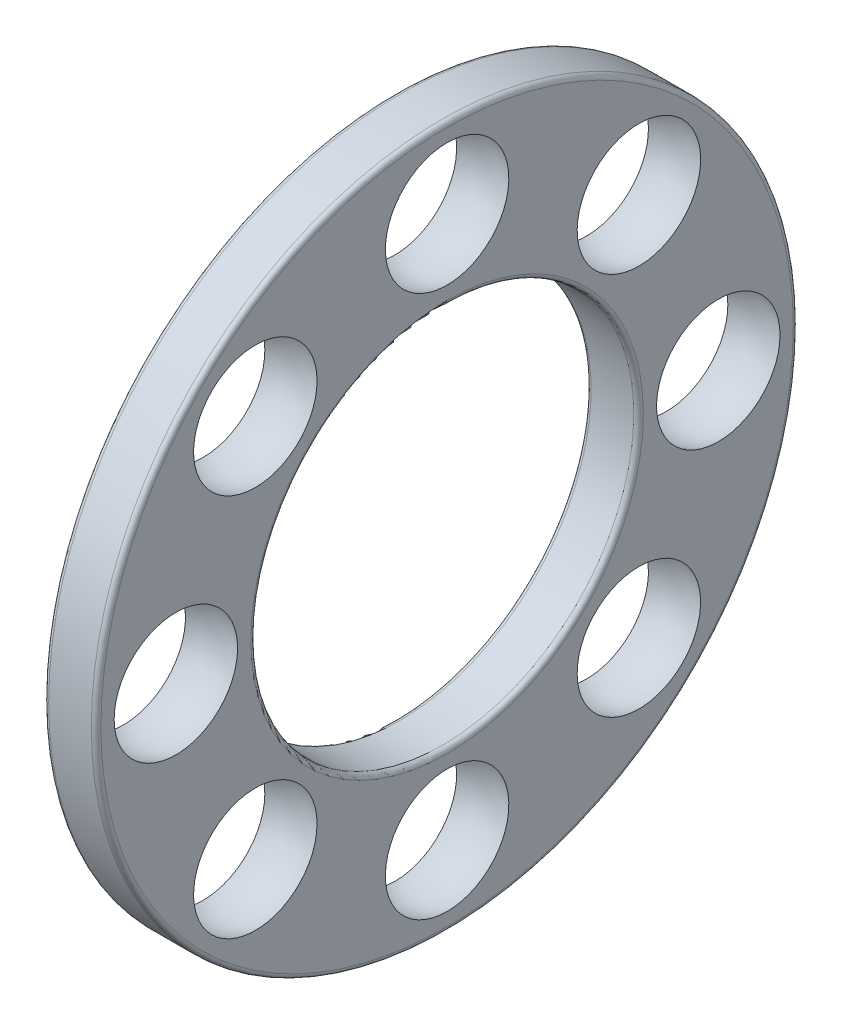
ISO-10303-21;
HEADER;
FILE_DESCRIPTION(('STEP AP214'),'2;1');
FILE_NAME('part.step','',(''),(''),'','','');
FILE_SCHEMA(('AUTOMOTIVE_DESIGN { 1 0 10303 214 1 1 1 1 }'));
ENDSEC;
DATA;
#1=APPLICATION_CONTEXT('core data for automotive mechanical design processes');
#2=APPLICATION_PROTOCOL_DEFINITION('international standard','automotive_design',2000,#1);
#3=PRODUCT_CONTEXT('',#1,'mechanical');
#4=PRODUCT('Part','Part','',(#3));
#5=PRODUCT_RELATED_PRODUCT_CATEGORY('part','',(#4));
#6=PRODUCT_DEFINITION_FORMATION('','',#4);
#7=PRODUCT_DEFINITION_CONTEXT('part definition',#1,'design');
#8=PRODUCT_DEFINITION('design','',#6,#7);
#9=PRODUCT_DEFINITION_SHAPE('','',#8);
#10=(LENGTH_UNIT() NAMED_UNIT(*) SI_UNIT(.MILLI.,.METRE.));
#11=(NAMED_UNIT(*) PLANE_ANGLE_UNIT() SI_UNIT($,.RADIAN.));
#12=(NAMED_UNIT(*) SI_UNIT($,.STERADIAN.) SOLID_ANGLE_UNIT());
#13=UNCERTAINTY_MEASURE_WITH_UNIT(LENGTH_MEASURE(1.E-05),#10,'distance_accuracy_value','');
#14=(GEOMETRIC_REPRESENTATION_CONTEXT(3) GLOBAL_UNCERTAINTY_ASSIGNED_CONTEXT((#13)) GLOBAL_UNIT_ASSIGNED_CONTEXT((#10,
#11,#12)) REPRESENTATION_CONTEXT('',''));
#15=CARTESIAN_POINT('',(0.,0.,0.));
#16=DIRECTION('',(0.,0.,1.));
#17=DIRECTION('',(1.,0.,0.));
#18=AXIS2_PLACEMENT_3D('',#15,#16,#17);
#19=CARTESIAN_POINT('',(-0.667981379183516,3.88578058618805E-13,0.));
#20=DIRECTION('',(-1.00000000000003,0.,0.));
#21=DIRECTION('',(0.,0.,1.00000000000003));
#22=AXIS2_PLACEMENT_3D('',#19,#20,#21);
#23=TOROIDAL_SURFACE('',#22,10.85,0.15);
#24=CARTESIAN_POINT('',(-0.817981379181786,2.83106871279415E-12,0.));
#25=DIRECTION('',(-1.00000000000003,0.,0.));
#26=DIRECTION('',(0.,0.,1.00000000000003));
#27=AXIS2_PLACEMENT_3D('',#24,#25,#26);
#28=CIRCLE('',#27,10.85);
#29=CARTESIAN_POINT('',(-0.817981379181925,2.89659663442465E-12,10.8500000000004));
#30=VERTEX_POINT('',#29);
#31=EDGE_CURVE('E10',#30,#30,#28,.T.);
#32=ORIENTED_EDGE('',*,*,#31,.F.);
#33=EDGE_LOOP('',(#32));
#34=FACE_BOUND('',#33,.T.);
#35=CARTESIAN_POINT('',(-0.667981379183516,3.88578058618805E-13,0.));
#36=DIRECTION('',(-1.00000000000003,0.,0.));
#37=DIRECTION('',(0.,0.,1.00000000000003));
#38=AXIS2_PLACEMENT_3D('',#35,#36,#37);
#39=CIRCLE('',#38,11.);
#40=CARTESIAN_POINT('',(-0.667981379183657,4.55011896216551E-13,11.0000000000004));
#41=VERTEX_POINT('',#40);
#42=EDGE_CURVE('E89',#41,#41,#39,.T.);
#43=ORIENTED_EDGE('',*,*,#42,.T.);
#44=EDGE_LOOP('',(#43));
#45=FACE_BOUND('',#44,.T.);
#46=ADVANCED_FACE('F24',(#34,#45),#23,.T.);
#47=CARTESIAN_POINT('',(-0.817981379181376,6.15000000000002,0.));
#48=DIRECTION('',(1.00000000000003,0.,0.));
#49=DIRECTION('',(0.,0.,-1.00000000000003));
#50=AXIS2_PLACEMENT_3D('',#47,#48,#49);
#51=PLANE('',#50);
#52=CARTESIAN_POINT('',(-0.817981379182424,6.01040764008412,6.01040764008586));
#53=DIRECTION('',(1.00000000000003,0.,0.));
#54=DIRECTION('',(0.,0.,-1.00000000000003));
#55=AXIS2_PLACEMENT_3D('',#52,#53,#54);
#56=CIRCLE('',#55,1.93414230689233);
#57=CARTESIAN_POINT('',(-0.817981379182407,7.37805278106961,7.37805278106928));
#58=VERTEX_POINT('',#57);
#59=EDGE_CURVE('E66',#58,#58,#56,.T.);
#60=ORIENTED_EDGE('',*,*,#59,.T.);
#61=EDGE_LOOP('',(#60));
#62=FACE_BOUND('',#61,.T.);
#63=CARTESIAN_POINT('',(-0.817981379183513,1.13797860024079E-12,8.50000000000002));
#64=DIRECTION('',(1.00000000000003,0.,0.));
#65=DIRECTION('',(0.,0.,-1.00000000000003));
#66=AXIS2_PLACEMENT_3D('',#63,#64,#65);
#67=CIRCLE('',#66,1.93414230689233);
#68=CARTESIAN_POINT('',(-0.817981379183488,2.25201707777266E-12,10.4341423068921));
#69=VERTEX_POINT('',#68);
#70=EDGE_CURVE('E63',#69,#69,#67,.T.);
#71=ORIENTED_EDGE('',*,*,#70,.T.);
#72=EDGE_LOOP('',(#71));
#73=FACE_BOUND('',#72,.T.);
#74=CARTESIAN_POINT('',(-0.817981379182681,-6.01040764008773,6.01040764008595));
#75=DIRECTION('',(1.00000000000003,0.,0.));
#76=DIRECTION('',(0.,0.,-1.00000000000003));
#77=AXIS2_PLACEMENT_3D('',#74,#75,#76);
#78=CIRCLE('',#77,1.93414230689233);
#79=CARTESIAN_POINT('',(-0.817981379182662,-7.37805278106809,7.37805278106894));
#80=VERTEX_POINT('',#79);
#81=EDGE_CURVE('E60',#80,#80,#78,.T.);
#82=ORIENTED_EDGE('',*,*,#81,.T.);
#83=EDGE_LOOP('',(#82));
#84=FACE_BOUND('',#83,.T.);
#85=CARTESIAN_POINT('',(-0.817981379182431,-8.49999999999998,0.));
#86=DIRECTION('',(1.00000000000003,0.,0.));
#87=DIRECTION('',(0.,0.,-1.00000000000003));
#88=AXIS2_PLACEMENT_3D('',#85,#86,#87);
#89=CIRCLE('',#88,1.93414230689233);
#90=CARTESIAN_POINT('',(-0.81798137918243,-10.4341423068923,0.));
#91=VERTEX_POINT('',#90);
#92=EDGE_CURVE('E56',#91,#91,#89,.T.);
#93=ORIENTED_EDGE('',*,*,#92,.T.);
#94=EDGE_LOOP('',(#93));
#95=FACE_BOUND('',#94,.T.);
#96=CARTESIAN_POINT('',(-0.817981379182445,-6.01040764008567,-6.01040764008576));
#97=DIRECTION('',(1.00000000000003,0.,0.));
#98=DIRECTION('',(0.,0.,-1.00000000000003));
#99=AXIS2_PLACEMENT_3D('',#96,#97,#98);
#100=CIRCLE('',#99,1.93414230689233);
#101=CARTESIAN_POINT('',(-0.817981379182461,-7.37805278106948,-7.37805278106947));
#102=VERTEX_POINT('',#101);
#103=EDGE_CURVE('E52',#102,#102,#100,.T.);
#104=ORIENTED_EDGE('',*,*,#103,.T.);
#105=EDGE_LOOP('',(#104));
#106=FACE_BOUND('',#105,.T.);
#107=CARTESIAN_POINT('',(-0.817981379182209,2.1094237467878E-12,-8.50000000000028));
#108=DIRECTION('',(1.00000000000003,0.,0.));
#109=DIRECTION('',(0.,0.,-1.00000000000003));
#110=AXIS2_PLACEMENT_3D('',#107,#108,#109);
#111=CIRCLE('',#110,1.93414230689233);
#112=CARTESIAN_POINT('',(-0.817981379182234,2.09050737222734E-12,-10.4341423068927));
#113=VERTEX_POINT('',#112);
#114=EDGE_CURVE('E48',#113,#113,#111,.T.);
#115=ORIENTED_EDGE('',*,*,#114,.T.);
#116=EDGE_LOOP('',(#115));
#117=FACE_BOUND('',#116,.T.);
#118=CARTESIAN_POINT('',(-0.817981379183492,6.01040764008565,-6.01040764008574));
#119=DIRECTION('',(1.00000000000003,0.,0.));
#120=DIRECTION('',(0.,0.,-1.00000000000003));
#121=AXIS2_PLACEMENT_3D('',#118,#119,#120);
#122=CIRCLE('',#121,1.93414230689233);
#123=CARTESIAN_POINT('',(-0.817981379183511,7.37805278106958,-7.37805278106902));
#124=VERTEX_POINT('',#123);
#125=EDGE_CURVE('E44',#124,#124,#122,.T.);
#126=ORIENTED_EDGE('',*,*,#125,.T.);
#127=EDGE_LOOP('',(#126));
#128=FACE_BOUND('',#127,.T.);
#129=CARTESIAN_POINT('',(-0.817981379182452,8.49999999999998,0.));
#130=DIRECTION('',(1.00000000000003,0.,0.));
#131=DIRECTION('',(0.,0.,-1.00000000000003));
#132=AXIS2_PLACEMENT_3D('',#129,#130,#131);
#133=CIRCLE('',#132,1.93414230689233);
#134=CARTESIAN_POINT('',(-0.817981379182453,10.4341423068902,0.));
#135=VERTEX_POINT('',#134);
#136=EDGE_CURVE('E43',#135,#135,#133,.T.);
#137=ORIENTED_EDGE('',*,*,#136,.T.);
#138=EDGE_LOOP('',(#137));
#139=FACE_BOUND('',#138,.T.);
#140=CARTESIAN_POINT('',(-0.817981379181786,2.83106871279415E-12,0.));
#141=DIRECTION('',(-1.00000000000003,0.,0.));
#142=DIRECTION('',(0.,0.,1.00000000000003));
#143=AXIS2_PLACEMENT_3D('',#140,#141,#142);
#144=CIRCLE('',#143,6.15);
#145=CARTESIAN_POINT('',(-0.817981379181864,2.86821126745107E-12,6.15000000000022));
#146=VERTEX_POINT('',#145);
#147=EDGE_CURVE('E31',#146,#146,#144,.T.);
#148=ORIENTED_EDGE('',*,*,#147,.F.);
#149=EDGE_LOOP('',(#148));
#150=FACE_BOUND('',#149,.T.);
#151=ORIENTED_EDGE('',*,*,#31,.T.);
#152=EDGE_LOOP('',(#151));
#153=FACE_BOUND('',#152,.T.);
#154=ADVANCED_FACE('F111',(#62,#73,#84,#95,#106,#117,#128,#139,#150,#153),#51,.F.);
#155=CARTESIAN_POINT('',(-0.667981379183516,3.88578058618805E-13,0.));
#156=DIRECTION('',(-1.00000000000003,0.,0.));
#157=DIRECTION('',(0.,0.,1.00000000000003));
#158=AXIS2_PLACEMENT_3D('',#155,#156,#157);
#159=TOROIDAL_SURFACE('',#158,6.15,0.15);
#160=CARTESIAN_POINT('',(-0.667981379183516,3.88578058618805E-13,0.));
#161=DIRECTION('',(-1.00000000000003,0.,0.));
#162=DIRECTION('',(0.,0.,1.00000000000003));
#163=AXIS2_PLACEMENT_3D('',#160,#161,#162);
#164=CIRCLE('',#163,6.);
#165=CARTESIAN_POINT('',(-0.667981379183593,4.24814697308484E-13,6.00000000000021));
#166=VERTEX_POINT('',#165);
#167=EDGE_CURVE('E36',#166,#166,#164,.T.);
#168=ORIENTED_EDGE('',*,*,#167,.F.);
#169=EDGE_LOOP('',(#168));
#170=FACE_BOUND('',#169,.T.);
#171=ORIENTED_EDGE('',*,*,#147,.T.);
#172=EDGE_LOOP('',(#171));
#173=FACE_BOUND('',#172,.T.);
#174=ADVANCED_FACE('F108',(#170,#173),#159,.T.);
#175=CARTESIAN_POINT('',(-6.56248115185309,1.36002320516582E-12,0.));
#176=DIRECTION('',(-1.00000000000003,0.,0.));
#177=DIRECTION('',(0.,0.,1.00000000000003));
#178=AXIS2_PLACEMENT_3D('',#175,#176,#177);
#179=CYLINDRICAL_SURFACE('',#178,6.);
#180=CARTESIAN_POINT('',(0.667981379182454,0.,0.));
#181=DIRECTION('',(-1.00000000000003,0.,0.));
#182=DIRECTION('',(0.,0.,1.00000000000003));
#183=AXIS2_PLACEMENT_3D('',#180,#181,#182);
#184=CIRCLE('',#183,6.);
#185=CARTESIAN_POINT('',(0.667981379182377,0.,6.00000000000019));
#186=VERTEX_POINT('',#185);
#187=EDGE_CURVE('E101',#186,#186,#184,.T.);
#188=ORIENTED_EDGE('',*,*,#187,.F.);
#189=EDGE_LOOP('',(#188));
#190=FACE_BOUND('',#189,.T.);
#191=ORIENTED_EDGE('',*,*,#167,.T.);
#192=EDGE_LOOP('',(#191));
#193=FACE_BOUND('',#192,.T.);
#194=ADVANCED_FACE('F106',(#190,#193),#179,.F.);
#195=CARTESIAN_POINT('',(0.667981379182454,0.,0.));
#196=DIRECTION('',(-1.00000000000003,0.,0.));
#197=DIRECTION('',(0.,0.,1.00000000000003));
#198=AXIS2_PLACEMENT_3D('',#195,#196,#197);
#199=TOROIDAL_SURFACE('',#198,6.15,0.15);
#200=CARTESIAN_POINT('',(0.817981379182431,0.,0.));
#201=DIRECTION('',(-1.00000000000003,0.,0.));
#202=DIRECTION('',(0.,0.,1.00000000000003));
#203=AXIS2_PLACEMENT_3D('',#200,#201,#202);
#204=CIRCLE('',#203,6.15);
#205=CARTESIAN_POINT('',(0.817981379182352,0.,6.15000000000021));
#206=VERTEX_POINT('',#205);
#207=EDGE_CURVE('E98',#206,#206,#204,.T.);
#208=ORIENTED_EDGE('',*,*,#207,.F.);
#209=EDGE_LOOP('',(#208));
#210=FACE_BOUND('',#209,.T.);
#211=ORIENTED_EDGE('',*,*,#187,.T.);
#212=EDGE_LOOP('',(#211));
#213=FACE_BOUND('',#212,.T.);
#214=ADVANCED_FACE('F124',(#210,#213),#199,.T.);
#215=CARTESIAN_POINT('',(0.817981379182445,6.14999999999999,0.));
#216=DIRECTION('',(-1.00000000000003,0.,0.));
#217=DIRECTION('',(0.,0.,1.00000000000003));
#218=AXIS2_PLACEMENT_3D('',#215,#216,#217);
#219=PLANE('',#218);
#220=CARTESIAN_POINT('',(0.817981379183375,6.0104076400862,6.01040764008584));
#221=DIRECTION('',(-1.00000000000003,0.,0.));
#222=DIRECTION('',(0.,0.,1.00000000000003));
#223=AXIS2_PLACEMENT_3D('',#220,#221,#222);
#224=CIRCLE('',#223,1.93414230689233);
#225=CARTESIAN_POINT('',(0.817981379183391,7.37805278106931,7.37805278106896));
#226=VERTEX_POINT('',#225);
#227=EDGE_CURVE('E27',#226,#226,#224,.T.);
#228=ORIENTED_EDGE('',*,*,#227,.T.);
#229=EDGE_LOOP('',(#228));
#230=FACE_BOUND('',#229,.T.);
#231=CARTESIAN_POINT('',(0.817981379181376,0.,8.5));
#232=DIRECTION('',(-1.00000000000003,0.,0.));
#233=DIRECTION('',(0.,0.,1.00000000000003));
#234=AXIS2_PLACEMENT_3D('',#231,#232,#233);
#235=CIRCLE('',#234,1.93414230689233);
#236=CARTESIAN_POINT('',(0.817981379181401,2.25299293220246E-12,10.4341423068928));
#237=VERTEX_POINT('',#236);
#238=EDGE_CURVE('E64',#237,#237,#235,.T.);
#239=ORIENTED_EDGE('',*,*,#238,.T.);
#240=EDGE_LOOP('',(#239));
#241=FACE_BOUND('',#240,.T.);
#242=CARTESIAN_POINT('',(0.817981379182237,-6.01040764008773,6.01040764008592));
#243=DIRECTION('',(-1.00000000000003,0.,0.));
#244=DIRECTION('',(0.,0.,1.00000000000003));
#245=AXIS2_PLACEMENT_3D('',#242,#243,#244);
#246=CIRCLE('',#245,1.93414230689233);
#247=CARTESIAN_POINT('',(0.817981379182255,-7.37805278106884,7.37805278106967));
#248=VERTEX_POINT('',#247);
#249=EDGE_CURVE('E61',#248,#248,#246,.T.);
#250=ORIENTED_EDGE('',*,*,#249,.T.);
#251=EDGE_LOOP('',(#250));
#252=FACE_BOUND('',#251,.T.);
#253=CARTESIAN_POINT('',(0.817981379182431,-8.49999999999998,0.));
#254=DIRECTION('',(-1.00000000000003,0.,0.));
#255=DIRECTION('',(0.,0.,1.00000000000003));
#256=AXIS2_PLACEMENT_3D('',#253,#254,#255);
#257=CIRCLE('',#256,1.93414230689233);
#258=CARTESIAN_POINT('',(0.817981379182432,-10.4341423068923,0.));
#259=VERTEX_POINT('',#258);
#260=EDGE_CURVE('E57',#259,#259,#257,.T.);
#261=ORIENTED_EDGE('',*,*,#260,.T.);
#262=EDGE_LOOP('',(#261));
#263=FACE_BOUND('',#262,.T.);
#264=CARTESIAN_POINT('',(0.817981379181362,-6.01040764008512,-6.01040764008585));
#265=DIRECTION('',(-1.00000000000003,0.,0.));
#266=DIRECTION('',(0.,0.,1.00000000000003));
#267=AXIS2_PLACEMENT_3D('',#264,#265,#266);
#268=CIRCLE('',#267,1.93414230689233);
#269=CARTESIAN_POINT('',(0.817981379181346,-7.37805278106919,-7.3780527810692));
#270=VERTEX_POINT('',#269);
#271=EDGE_CURVE('E53',#270,#270,#268,.T.);
#272=ORIENTED_EDGE('',*,*,#271,.T.);
#273=EDGE_LOOP('',(#272));
#274=FACE_BOUND('',#273,.T.);
#275=CARTESIAN_POINT('',(0.817981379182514,2.1094237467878E-12,-8.50000000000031));
#276=DIRECTION('',(-1.00000000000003,0.,0.));
#277=DIRECTION('',(0.,0.,1.00000000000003));
#278=AXIS2_PLACEMENT_3D('',#275,#276,#277);
#279=CIRCLE('',#278,1.93414230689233);
#280=CARTESIAN_POINT('',(0.817981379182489,2.09148322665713E-12,-10.4341423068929));
#281=VERTEX_POINT('',#280);
#282=EDGE_CURVE('E49',#281,#281,#279,.T.);
#283=ORIENTED_EDGE('',*,*,#282,.T.);
#284=EDGE_LOOP('',(#283));
#285=FACE_BOUND('',#284,.T.);
#286=CARTESIAN_POINT('',(0.817981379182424,6.01040764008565,-6.01040764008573));
#287=DIRECTION('',(-1.00000000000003,0.,0.));
#288=DIRECTION('',(0.,0.,1.00000000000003));
#289=AXIS2_PLACEMENT_3D('',#286,#287,#288);
#290=CIRCLE('',#289,1.93414230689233);
#291=CARTESIAN_POINT('',(0.817981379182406,7.37805278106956,-7.37805278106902));
#292=VERTEX_POINT('',#291);
#293=EDGE_CURVE('E45',#292,#292,#290,.T.);
#294=ORIENTED_EDGE('',*,*,#293,.T.);
#295=EDGE_LOOP('',(#294));
#296=FACE_BOUND('',#295,.T.);
#297=CARTESIAN_POINT('',(0.817981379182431,8.49999999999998,0.));
#298=DIRECTION('',(-1.00000000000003,0.,0.));
#299=DIRECTION('',(0.,0.,1.00000000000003));
#300=AXIS2_PLACEMENT_3D('',#297,#298,#299);
#301=CIRCLE('',#300,1.93414230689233);
#302=CARTESIAN_POINT('',(0.81798137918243,10.4341423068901,0.));
#303=VERTEX_POINT('',#302);
#304=EDGE_CURVE('E40',#303,#303,#301,.T.);
#305=ORIENTED_EDGE('',*,*,#304,.T.);
#306=EDGE_LOOP('',(#305));
#307=FACE_BOUND('',#306,.T.);
#308=CARTESIAN_POINT('',(0.817981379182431,0.,0.));
#309=DIRECTION('',(-1.00000000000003,0.,0.));
#310=DIRECTION('',(0.,0.,1.00000000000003));
#311=AXIS2_PLACEMENT_3D('',#308,#309,#310);
#312=CIRCLE('',#311,10.85);
#313=CARTESIAN_POINT('',(0.817981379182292,0.,10.8500000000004));
#314=VERTEX_POINT('',#313);
#315=EDGE_CURVE('E95',#314,#314,#312,.T.);
#316=ORIENTED_EDGE('',*,*,#315,.F.);
#317=EDGE_LOOP('',(#316));
#318=FACE_BOUND('',#317,.T.);
#319=ORIENTED_EDGE('',*,*,#207,.T.);
#320=EDGE_LOOP('',(#319));
#321=FACE_BOUND('',#320,.T.);
#322=ADVANCED_FACE('F128',(#230,#241,#252,#263,#274,#285,#296,#307,#318,#321),#219,.F.);
#323=CARTESIAN_POINT('',(0.667981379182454,0.,0.));
#324=DIRECTION('',(-1.00000000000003,0.,0.));
#325=DIRECTION('',(0.,0.,1.00000000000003));
#326=AXIS2_PLACEMENT_3D('',#323,#324,#325);
#327=TOROIDAL_SURFACE('',#326,10.85,0.15);
#328=CARTESIAN_POINT('',(0.667981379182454,0.,0.));
#329=DIRECTION('',(-1.00000000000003,0.,0.));
#330=DIRECTION('',(0.,0.,1.00000000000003));
#331=AXIS2_PLACEMENT_3D('',#328,#329,#330);
#332=CIRCLE('',#331,11.);
#333=CARTESIAN_POINT('',(0.667981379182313,0.,11.0000000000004));
#334=VERTEX_POINT('',#333);
#335=EDGE_CURVE('E92',#334,#334,#332,.T.);
#336=ORIENTED_EDGE('',*,*,#335,.F.);
#337=EDGE_LOOP('',(#336));
#338=FACE_BOUND('',#337,.T.);
#339=ORIENTED_EDGE('',*,*,#315,.T.);
#340=EDGE_LOOP('',(#339));
#341=FACE_BOUND('',#340,.T.);
#342=ADVANCED_FACE('F132',(#338,#341),#327,.T.);
#343=CARTESIAN_POINT('',(-6.56248115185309,1.36002320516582E-12,0.));
#344=DIRECTION('',(-1.00000000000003,0.,0.));
#345=DIRECTION('',(0.,0.,1.00000000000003));
#346=AXIS2_PLACEMENT_3D('',#343,#344,#345);
#347=CYLINDRICAL_SURFACE('',#346,11.);
#348=ORIENTED_EDGE('',*,*,#42,.F.);
#349=EDGE_LOOP('',(#348));
#350=FACE_BOUND('',#349,.T.);
#351=ORIENTED_EDGE('',*,*,#335,.T.);
#352=EDGE_LOOP('',(#351));
#353=FACE_BOUND('',#352,.T.);
#354=ADVANCED_FACE('F136',(#350,#353),#347,.T.);
#355=CARTESIAN_POINT('',(-1.31838984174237E-13,8.49999999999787,0.));
#356=DIRECTION('',(1.00000000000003,0.,0.));
#357=DIRECTION('',(0.,0.999999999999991,0.));
#358=AXIS2_PLACEMENT_3D('',#355,#356,#357);
#359=SPHERICAL_SURFACE('',#358,2.1);
#360=CARTESIAN_POINT('',(0.81798137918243,10.4341423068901,0.));
#361=CARTESIAN_POINT('',(0.801859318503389,10.4409606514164,0.));
#362=CARTESIAN_POINT('',(0.785651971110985,10.4475773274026,0.));
#363=CARTESIAN_POINT('',(0.753076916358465,10.460403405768,0.));
#364=CARTESIAN_POINT('',(0.736709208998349,10.4666128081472,0.));
#365=CARTESIAN_POINT('',(0.703823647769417,10.4786204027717,0.));
#366=CARTESIAN_POINT('',(0.687305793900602,10.4844185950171,0.));
#367=CARTESIAN_POINT('',(0.654130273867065,10.4956001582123,0.));
#368=CARTESIAN_POINT('',(0.637472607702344,10.5009835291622,0.));
#369=CARTESIAN_POINT('',(0.604027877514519,10.5113320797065,0.));
#370=CARTESIAN_POINT('',(0.587240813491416,10.516297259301,0.));
#371=CARTESIAN_POINT('',(0.553547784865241,10.5258063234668,0.));
#372=CARTESIAN_POINT('',(0.536641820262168,10.5303502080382,0.));
#373=CARTESIAN_POINT('',(0.502721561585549,10.5390138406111,0.));
#374=CARTESIAN_POINT('',(0.485707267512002,10.5431335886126,0.));
#375=CARTESIAN_POINT('',(0.451580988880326,10.5509463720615,0.));
#376=CARTESIAN_POINT('',(0.434469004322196,10.5546394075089,0.));
#377=CARTESIAN_POINT('',(0.400158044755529,10.5615964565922,0.));
#378=CARTESIAN_POINT('',(0.382959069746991,10.5648604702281,0.));
#379=CARTESIAN_POINT('',(0.348484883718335,10.5709574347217,0.));
#380=CARTESIAN_POINT('',(0.331209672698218,10.5737903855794,0.));
#381=CARTESIAN_POINT('',(0.296593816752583,10.5790234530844,0.));
#382=CARTESIAN_POINT('',(0.279253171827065,10.5814235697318,0.));
#383=CARTESIAN_POINT('',(0.244517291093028,10.5857894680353,0.));
#384=CARTESIAN_POINT('',(0.22712205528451,10.5877552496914,0.));
#385=CARTESIAN_POINT('',(0.192287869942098,10.5912512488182,0.));
#386=CARTESIAN_POINT('',(0.174848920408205,10.592781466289,0.));
#387=CARTESIAN_POINT('',(0.139938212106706,10.5954053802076,0.));
#388=CARTESIAN_POINT('',(0.122466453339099,10.5964990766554,0.));
#389=CARTESIAN_POINT('',(0.0875010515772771,10.598249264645,0.));
#390=CARTESIAN_POINT('',(0.0700074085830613,10.5989057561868,0.));
#391=CARTESIAN_POINT('',(0.0350091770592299,10.5997811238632,0.));
#392=CARTESIAN_POINT('',(0.0175045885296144,10.5999999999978,0.));
#393=CARTESIAN_POINT('',(-0.0175045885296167,10.5999999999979,0.));
#394=CARTESIAN_POINT('',(-0.0350091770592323,10.5997811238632,0.));
#395=CARTESIAN_POINT('',(-0.0700074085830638,10.5989057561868,0.));
#396=CARTESIAN_POINT('',(-0.0875010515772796,10.598249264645,0.));
#397=CARTESIAN_POINT('',(-0.122466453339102,10.5964990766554,0.));
#398=CARTESIAN_POINT('',(-0.139938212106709,10.5954053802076,0.));
#399=CARTESIAN_POINT('',(-0.174848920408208,10.592781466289,0.));
#400=CARTESIAN_POINT('',(-0.192287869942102,10.5912512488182,0.));
#401=CARTESIAN_POINT('',(-0.227122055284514,10.5877552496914,0.));
#402=CARTESIAN_POINT('',(-0.244517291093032,10.5857894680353,0.));
#403=CARTESIAN_POINT('',(-0.27925317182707,10.5814235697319,0.));
#404=CARTESIAN_POINT('',(-0.296593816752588,10.5790234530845,0.));
#405=CARTESIAN_POINT('',(-0.331209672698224,10.5737903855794,0.));
#406=CARTESIAN_POINT('',(-0.348484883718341,10.5709574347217,0.));
#407=CARTESIAN_POINT('',(-0.382959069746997,10.5648604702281,0.));
#408=CARTESIAN_POINT('',(-0.400158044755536,10.5615964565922,0.));
#409=CARTESIAN_POINT('',(-0.434469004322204,10.554639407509,0.));
#410=CARTESIAN_POINT('',(-0.451580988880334,10.5509463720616,0.));
#411=CARTESIAN_POINT('',(-0.485707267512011,10.5431335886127,0.));
#412=CARTESIAN_POINT('',(-0.502721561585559,10.5390138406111,0.));
#413=CARTESIAN_POINT('',(-0.536641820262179,10.5303502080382,0.));
#414=CARTESIAN_POINT('',(-0.553547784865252,10.5258063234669,0.));
#415=CARTESIAN_POINT('',(-0.587240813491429,10.5162972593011,0.));
#416=CARTESIAN_POINT('',(-0.604027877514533,10.5113320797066,0.));
#417=CARTESIAN_POINT('',(-0.637472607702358,10.5009835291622,0.));
#418=CARTESIAN_POINT('',(-0.65413027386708,10.4956001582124,0.));
#419=CARTESIAN_POINT('',(-0.687305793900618,10.4844185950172,0.));
#420=CARTESIAN_POINT('',(-0.703823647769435,10.4786204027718,0.));
#421=CARTESIAN_POINT('',(-0.736709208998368,10.4666128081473,0.));
#422=CARTESIAN_POINT('',(-0.753076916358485,10.4604034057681,0.));
#423=CARTESIAN_POINT('',(-0.785651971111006,10.4475773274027,0.));
#424=CARTESIAN_POINT('',(-0.801859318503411,10.4409606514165,0.));
#425=CARTESIAN_POINT('',(-0.817981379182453,10.4341423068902,0.));
#426=B_SPLINE_CURVE_WITH_KNOTS('',3,(#360,#361,#362,#363,#364,#365,#366,#367,#368,#369,#370,
#371,#372,#373,#374,#375,#376,#377,#378,#379,#380,#381,#382,#383,#384,#385,#386,#387,#388,#389,
#390,#391,#392,#393,#394,#395,#396,#397,#398,#399,#400,#401,#402,#403,#404,#405,#406,#407,#408,
#409,#410,#411,#412,#413,#414,#415,#416,#417,#418,#419,#420,#421,#422,#423,#424,#425),
.UNSPECIFIED.,.F.,.F.,(4,2,2,2,2,2,2,2,2,2,2,2,2,2,2,2,2,2,2,2,2,2,2,2,2,2,2,2,2,2,2,2,4),(0.,
0.052512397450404,0.105024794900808,0.157537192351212,0.210049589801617,0.262561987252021,
0.315074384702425,0.36758678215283,0.420099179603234,0.472611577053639,0.525123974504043,
0.577636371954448,0.630148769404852,0.682661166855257,0.735173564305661,0.787685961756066,
0.84019835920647,0.892710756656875,0.945223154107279,0.997735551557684,1.05024794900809,
1.10276034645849,1.1552727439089,1.2077851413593,1.26029753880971,1.31280993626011,
1.36532233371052,1.41783473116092,1.47034712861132,1.52285952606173,1.57537192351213,
1.62788432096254,1.68039671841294),.UNSPECIFIED.);
#427=EDGE_CURVE('BSEAM140',#303,#135,#426,.T.);
#428=ORIENTED_EDGE('',*,*,#304,.F.);
#429=ORIENTED_EDGE('',*,*,#136,.F.);
#430=ORIENTED_EDGE('',*,*,#427,.T.);
#431=ORIENTED_EDGE('',*,*,#427,.F.);
#432=EDGE_LOOP('',(#428,#430,#429,#431));
#433=FACE_BOUND('',#432,.T.);
#434=ADVANCED_FACE('F140',(#433),#359,.F.);
#435=CARTESIAN_POINT('',(-6.10622663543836E-13,6.01040764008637,-6.01040764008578));
#436=DIRECTION('',(1.00000000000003,0.,0.));
#437=DIRECTION('',(0.,0.70710678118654,-0.707106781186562));
#438=AXIS2_PLACEMENT_3D('',#435,#436,#437);
#439=SPHERICAL_SURFACE('',#438,2.1);
#440=CARTESIAN_POINT('',(0.817981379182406,7.37805278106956,-7.37805278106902));
#441=CARTESIAN_POINT('',(0.801859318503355,7.38287407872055,-7.38287407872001));
#442=CARTESIAN_POINT('',(0.785651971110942,7.38755277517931,-7.38755277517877));
#443=CARTESIAN_POINT('',(0.753076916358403,7.39662218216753,-7.396622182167));
#444=CARTESIAN_POINT('',(0.736709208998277,7.40101289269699,-7.40101289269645));
#445=CARTESIAN_POINT('',(0.703823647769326,7.40950354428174,-7.4095035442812));
#446=CARTESIAN_POINT('',(0.687305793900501,7.41360348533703,-7.4136034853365));
#447=CARTESIAN_POINT('',(0.654130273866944,7.42151004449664,-7.42151004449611));
#448=CARTESIAN_POINT('',(0.637472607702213,7.42531666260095,-7.42531666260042));
#449=CARTESIAN_POINT('',(0.604027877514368,7.43263419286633,-7.43263419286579));
#450=CARTESIAN_POINT('',(0.587240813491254,7.43614510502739,-7.43614510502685));
#451=CARTESIAN_POINT('',(0.553547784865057,7.44286902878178,-7.44286902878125));
#452=CARTESIAN_POINT('',(0.536641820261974,7.44608204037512,-7.44608204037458));
#453=CARTESIAN_POINT('',(0.502721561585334,7.45220815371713,-7.45220815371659));
#454=CARTESIAN_POINT('',(0.485707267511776,7.45512125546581,-7.45512125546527));
#455=CARTESIAN_POINT('',(0.451580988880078,7.46064572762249,-7.46064572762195));
#456=CARTESIAN_POINT('',(0.434469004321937,7.4632570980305,-7.46325709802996));
#457=CARTESIAN_POINT('',(0.400158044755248,7.46817647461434,-7.4681764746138));
#458=CARTESIAN_POINT('',(0.382959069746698,7.47048448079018,-7.47048448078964));
#459=CARTESIAN_POINT('',(0.34848488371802,7.47479568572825,-7.47479568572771));
#460=CARTESIAN_POINT('',(0.331209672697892,7.47679888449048,-7.47679888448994));
#461=CARTESIAN_POINT('',(0.296593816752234,7.48049922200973,-7.48049922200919));
#462=CARTESIAN_POINT('',(0.279253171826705,7.48219636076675,-7.48219636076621));
#463=CARTESIAN_POINT('',(0.244517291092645,7.48528351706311,-7.48528351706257));
#464=CARTESIAN_POINT('',(0.227122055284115,7.48667353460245,-7.48667353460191));
#465=CARTESIAN_POINT('',(0.19228786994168,7.48914557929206,-7.48914557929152));
#466=CARTESIAN_POINT('',(0.174848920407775,7.49022760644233,-7.49022760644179));
#467=CARTESIAN_POINT('',(0.139938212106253,7.49208299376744,-7.49208299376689));
#468=CARTESIAN_POINT('',(0.122466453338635,7.49285635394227,-7.49285635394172));
#469=CARTESIAN_POINT('',(0.0875010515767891,7.49409392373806,-7.49409392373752));
#470=CARTESIAN_POINT('',(0.0700074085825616,7.49455813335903,-7.49455813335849));
#471=CARTESIAN_POINT('',(0.0350091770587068,7.49517711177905,-7.49517711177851));
#472=CARTESIAN_POINT('',(0.0175045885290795,7.4953318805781,-7.49533188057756));
#473=CARTESIAN_POINT('',(-0.017504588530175,7.4953318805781,-7.49533188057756));
#474=CARTESIAN_POINT('',(-0.0350091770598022,7.49517711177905,-7.49517711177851));
#475=CARTESIAN_POINT('',(-0.070007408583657,7.49455813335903,-7.49455813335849));
#476=CARTESIAN_POINT('',(-0.0875010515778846,7.49409392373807,-7.49409392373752));
#477=CARTESIAN_POINT('',(-0.12246645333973,7.49285635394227,-7.49285635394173));
#478=CARTESIAN_POINT('',(-0.139938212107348,7.49208299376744,-7.4920829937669));
#479=CARTESIAN_POINT('',(-0.174848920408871,7.49022760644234,-7.49022760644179));
#480=CARTESIAN_POINT('',(-0.192287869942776,7.48914557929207,-7.48914557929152));
#481=CARTESIAN_POINT('',(-0.227122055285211,7.48667353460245,-7.48667353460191));
#482=CARTESIAN_POINT('',(-0.244517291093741,7.48528351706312,-7.48528351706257));
#483=CARTESIAN_POINT('',(-0.279253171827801,7.48219636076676,-7.48219636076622));
#484=CARTESIAN_POINT('',(-0.296593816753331,7.48049922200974,-7.4804992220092));
#485=CARTESIAN_POINT('',(-0.331209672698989,7.47679888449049,-7.47679888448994));
#486=CARTESIAN_POINT('',(-0.348484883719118,7.47479568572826,-7.47479568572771));
#487=CARTESIAN_POINT('',(-0.382959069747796,7.47048448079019,-7.47048448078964));
#488=CARTESIAN_POINT('',(-0.400158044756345,7.46817647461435,-7.4681764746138));
#489=CARTESIAN_POINT('',(-0.434469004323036,7.46325709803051,-7.46325709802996));
#490=CARTESIAN_POINT('',(-0.451580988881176,7.4606457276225,-7.46064572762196));
#491=CARTESIAN_POINT('',(-0.485707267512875,7.45512125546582,-7.45512125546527));
#492=CARTESIAN_POINT('',(-0.502721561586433,7.45220815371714,-7.45220815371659));
#493=CARTESIAN_POINT('',(-0.536641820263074,7.44608204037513,-7.44608204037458));
#494=CARTESIAN_POINT('',(-0.553547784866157,7.4428690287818,-7.44286902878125));
#495=CARTESIAN_POINT('',(-0.587240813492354,7.43614510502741,-7.43614510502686));
#496=CARTESIAN_POINT('',(-0.604027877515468,7.43263419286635,-7.43263419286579));
#497=CARTESIAN_POINT('',(-0.637472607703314,7.42531666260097,-7.42531666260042));
#498=CARTESIAN_POINT('',(-0.654130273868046,7.42151004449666,-7.42151004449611));
#499=CARTESIAN_POINT('',(-0.687305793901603,7.41360348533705,-7.4136034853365));
#500=CARTESIAN_POINT('',(-0.703823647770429,7.40950354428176,-7.40950354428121));
#501=CARTESIAN_POINT('',(-0.736709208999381,7.40101289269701,-7.40101289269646));
#502=CARTESIAN_POINT('',(-0.753076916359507,7.39662218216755,-7.396622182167));
#503=CARTESIAN_POINT('',(-0.785651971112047,7.38755277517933,-7.38755277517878));
#504=CARTESIAN_POINT('',(-0.80185931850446,7.38287407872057,-7.38287407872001));
#505=CARTESIAN_POINT('',(-0.817981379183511,7.37805278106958,-7.37805278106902));
#506=B_SPLINE_CURVE_WITH_KNOTS('',3,(#440,#441,#442,#443,#444,#445,#446,#447,#448,#449,#450,
#451,#452,#453,#454,#455,#456,#457,#458,#459,#460,#461,#462,#463,#464,#465,#466,#467,#468,#469,
#470,#471,#472,#473,#474,#475,#476,#477,#478,#479,#480,#481,#482,#483,#484,#485,#486,#487,#488,
#489,#490,#491,#492,#493,#494,#495,#496,#497,#498,#499,#500,#501,#502,#503,#504,#505),
.UNSPECIFIED.,.F.,.F.,(4,2,2,2,2,2,2,2,2,2,2,2,2,2,2,2,2,2,2,2,2,2,2,2,2,2,2,2,2,2,2,2,4),(0.,
0.052512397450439,0.105024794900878,0.157537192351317,0.210049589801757,0.262561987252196,
0.315074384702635,0.367586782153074,0.420099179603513,0.472611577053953,0.525123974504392,
0.577636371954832,0.630148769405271,0.682661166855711,0.73517356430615,0.78768596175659,
0.840198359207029,0.892710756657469,0.945223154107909,0.997735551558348,1.05024794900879,
1.10276034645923,1.15527274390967,1.20778514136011,1.26029753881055,1.31280993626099,
1.36532233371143,1.41783473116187,1.47034712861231,1.52285952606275,1.57537192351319,
1.62788432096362,1.68039671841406),.UNSPECIFIED.);
#507=EDGE_CURVE('BSEAM144',#292,#124,#506,.T.);
#508=ORIENTED_EDGE('',*,*,#293,.F.);
#509=ORIENTED_EDGE('',*,*,#125,.F.);
#510=ORIENTED_EDGE('',*,*,#507,.T.);
#511=ORIENTED_EDGE('',*,*,#507,.F.);
#512=EDGE_LOOP('',(#508,#510,#509,#511));
#513=FACE_BOUND('',#512,.T.);
#514=ADVANCED_FACE('F144',(#513),#439,.F.);
#515=CARTESIAN_POINT('',(3.05311331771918E-13,2.1094237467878E-12,-8.50000000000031));
#516=DIRECTION('',(1.00000000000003,0.,0.));
#517=DIRECTION('',(0.,0.,-1.00000000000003));
#518=AXIS2_PLACEMENT_3D('',#515,#516,#517);
#519=SPHERICAL_SURFACE('',#518,2.1);
#520=CARTESIAN_POINT('',(0.817981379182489,2.09148322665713E-12,-10.4341423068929));
#521=CARTESIAN_POINT('',(0.801859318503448,2.0914086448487E-12,-10.4409606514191));
#522=CARTESIAN_POINT('',(0.785651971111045,2.09133593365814E-12,-10.4475773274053));
#523=CARTESIAN_POINT('',(0.753076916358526,2.09119429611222E-12,-10.4604034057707));
#524=CARTESIAN_POINT('',(0.736709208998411,2.09112536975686E-12,-10.4666128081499));
#525=CARTESIAN_POINT('',(0.70382364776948,2.09099134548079E-12,-10.4786204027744));
#526=CARTESIAN_POINT('',(0.687305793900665,2.09092624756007E-12,-10.4844185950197));
#527=CARTESIAN_POINT('',(0.65413027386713,2.09079992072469E-12,-10.4956001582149));
#528=CARTESIAN_POINT('',(0.637472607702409,2.09073869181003E-12,-10.5009835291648));
#529=CARTESIAN_POINT('',(0.604027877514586,2.09062014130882E-12,-10.5113320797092));
#530=CARTESIAN_POINT('',(0.587240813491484,2.09056281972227E-12,-10.5162972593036));
#531=CARTESIAN_POINT('',(0.55354778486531,2.09045211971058E-12,-10.5258063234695));
#532=CARTESIAN_POINT('',(0.536641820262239,2.09039874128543E-12,-10.5303502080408));
#533=CARTESIAN_POINT('',(0.502721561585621,2.09029596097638E-12,-10.5390138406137));
#534=CARTESIAN_POINT('',(0.485707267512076,2.09024655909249E-12,-10.5431335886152));
#535=CARTESIAN_POINT('',(0.451580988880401,2.09015176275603E-12,-10.5509463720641));
#536=CARTESIAN_POINT('',(0.434469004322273,2.09010636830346E-12,-10.5546394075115));
#537=CARTESIAN_POINT('',(0.400158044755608,2.09001961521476E-12,-10.5615964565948));
#538=CARTESIAN_POINT('',(0.382959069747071,2.08997825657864E-12,-10.5648604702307));
#539=CARTESIAN_POINT('',(0.348484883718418,2.08989960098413E-12,-10.5709574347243));
#540=CARTESIAN_POINT('',(0.331209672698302,2.08986230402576E-12,-10.573790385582));
#541=CARTESIAN_POINT('',(0.29659381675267,2.08979179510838E-12,-10.579023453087));
#542=CARTESIAN_POINT('',(0.279253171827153,2.08975858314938E-12,-10.5814235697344));
#543=CARTESIAN_POINT('',(0.244517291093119,2.08969626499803E-12,-10.5857894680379));
#544=CARTESIAN_POINT('',(0.227122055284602,2.08966715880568E-12,-10.5877552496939));
#545=CARTESIAN_POINT('',(0.192287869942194,2.08961307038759E-12,-10.5912512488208));
#546=CARTESIAN_POINT('',(0.174848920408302,2.08958808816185E-12,-10.5927814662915));
#547=CARTESIAN_POINT('',(0.139938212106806,2.08954226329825E-12,-10.5954053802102));
#548=CARTESIAN_POINT('',(0.122466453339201,2.08952142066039E-12,-10.596499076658));
#549=CARTESIAN_POINT('',(0.0875010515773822,2.08948388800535E-12,-10.5982492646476));
#550=CARTESIAN_POINT('',(0.0700074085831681,2.08946719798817E-12,-10.5989057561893));
#551=CARTESIAN_POINT('',(0.0350091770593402,2.08943798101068E-12,-10.5997811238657));
#552=CARTESIAN_POINT('',(0.0175045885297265,2.08942545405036E-12,-10.6000000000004));
#553=CARTESIAN_POINT('',(-0.017504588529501,2.08940457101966E-12,-10.6000000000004));
#554=CARTESIAN_POINT('',(-0.0350091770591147,2.08939621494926E-12,-10.5997811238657));
#555=CARTESIAN_POINT('',(-0.0700074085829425,2.0893836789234E-12,-10.5989057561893));
#556=CARTESIAN_POINT('',(-0.0875010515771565,2.08937949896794E-12,-10.5982492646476));
#557=CARTESIAN_POINT('',(-0.122466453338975,2.08937531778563E-12,-10.596499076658));
#558=CARTESIAN_POINT('',(-0.13993821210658,2.0893753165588E-12,-10.5954053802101));
#559=CARTESIAN_POINT('',(-0.174848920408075,2.08937949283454E-12,-10.5927814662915));
#560=CARTESIAN_POINT('',(-0.192287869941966,2.0893836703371E-12,-10.5912512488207));
#561=CARTESIAN_POINT('',(-0.227122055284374,2.08939620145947E-12,-10.5877552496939));
#562=CARTESIAN_POINT('',(-0.244517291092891,2.08940455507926E-12,-10.5857894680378));
#563=CARTESIAN_POINT('',(-0.279253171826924,2.0894254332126E-12,-10.5814235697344));
#564=CARTESIAN_POINT('',(-0.296593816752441,2.08943795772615E-12,-10.579023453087));
#565=CARTESIAN_POINT('',(-0.331209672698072,2.08946716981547E-12,-10.5737903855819));
#566=CARTESIAN_POINT('',(-0.348484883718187,2.08948385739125E-12,-10.5709574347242));
#567=CARTESIAN_POINT('',(-0.382959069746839,2.08952138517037E-12,-10.5648604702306));
#568=CARTESIAN_POINT('',(-0.400158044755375,2.08954222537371E-12,-10.5615964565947));
#569=CARTESIAN_POINT('',(-0.434469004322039,2.08958804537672E-12,-10.5546394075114));
#570=CARTESIAN_POINT('',(-0.451580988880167,2.08961302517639E-12,-10.550946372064));
#571=CARTESIAN_POINT('',(-0.48570726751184,2.08966710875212E-12,-10.5431335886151));
#572=CARTESIAN_POINT('',(-0.502721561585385,2.08969621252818E-12,-10.5390138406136));
#573=CARTESIAN_POINT('',(-0.536641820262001,2.08975852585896E-12,-10.5303502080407));
#574=CARTESIAN_POINT('',(-0.553547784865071,2.08979173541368E-12,-10.5258063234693));
#575=CARTESIAN_POINT('',(-0.587240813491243,2.0898622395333E-12,-10.5162972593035));
#576=CARTESIAN_POINT('',(-0.604027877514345,2.0898995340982E-12,-10.511332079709));
#577=CARTESIAN_POINT('',(-0.637472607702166,2.08997818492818E-12,-10.5009835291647));
#578=CARTESIAN_POINT('',(-0.654130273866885,2.09001954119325E-12,-10.4956001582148));
#579=CARTESIAN_POINT('',(-0.687305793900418,2.09010628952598E-12,-10.4844185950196));
#580=CARTESIAN_POINT('',(-0.703823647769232,2.09015168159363E-12,-10.4786204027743));
#581=CARTESIAN_POINT('',(-0.736709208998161,2.09024647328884E-12,-10.4666128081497));
#582=CARTESIAN_POINT('',(-0.753076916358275,2.09029587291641E-12,-10.4604034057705));
#583=CARTESIAN_POINT('',(-0.785651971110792,2.0903986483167E-12,-10.4475773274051));
#584=CARTESIAN_POINT('',(-0.801859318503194,2.09045202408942E-12,-10.4409606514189));
#585=CARTESIAN_POINT('',(-0.817981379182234,2.09050737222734E-12,-10.4341423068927));
#586=B_SPLINE_CURVE_WITH_KNOTS('',3,(#520,#521,#522,#523,#524,#525,#526,#527,#528,#529,#530,
#531,#532,#533,#534,#535,#536,#537,#538,#539,#540,#541,#542,#543,#544,#545,#546,#547,#548,#549,
#550,#551,#552,#553,#554,#555,#556,#557,#558,#559,#560,#561,#562,#563,#564,#565,#566,#567,#568,
#569,#570,#571,#572,#573,#574,#575,#576,#577,#578,#579,#580,#581,#582,#583,#584,#585),
.UNSPECIFIED.,.F.,.F.,(4,2,2,2,2,2,2,2,2,2,2,2,2,2,2,2,2,2,2,2,2,2,2,2,2,2,2,2,2,2,2,2,4),(0.,
0.0525123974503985,0.105024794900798,0.157537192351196,0.210049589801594,0.262561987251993,
0.315074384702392,0.367586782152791,0.42009917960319,0.472611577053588,0.525123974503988,
0.577636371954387,0.630148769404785,0.682661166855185,0.735173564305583,0.787685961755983,
0.840198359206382,0.892710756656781,0.94522315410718,0.997735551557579,1.05024794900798,
1.10276034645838,1.15527274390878,1.20778514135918,1.26029753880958,1.31280993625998,
1.36532233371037,1.41783473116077,1.47034712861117,1.52285952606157,1.57537192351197,
1.62788432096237,1.68039671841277),.UNSPECIFIED.);
#587=EDGE_CURVE('BSEAM148',#281,#113,#586,.T.);
#588=ORIENTED_EDGE('',*,*,#282,.F.);
#589=ORIENTED_EDGE('',*,*,#114,.F.);
#590=ORIENTED_EDGE('',*,*,#587,.T.);
#591=ORIENTED_EDGE('',*,*,#587,.F.);
#592=EDGE_LOOP('',(#588,#590,#589,#591));
#593=FACE_BOUND('',#592,.T.);
#594=ADVANCED_FACE('F148',(#593),#519,.F.);
#595=CARTESIAN_POINT('',(-1.06858966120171E-12,-6.01040764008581,-6.01040764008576));
#596=DIRECTION('',(1.00000000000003,0.,0.));
#597=DIRECTION('',(0.,-0.707106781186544,-0.707106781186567));
#598=AXIS2_PLACEMENT_3D('',#595,#596,#597);
#599=SPHERICAL_SURFACE('',#598,2.1);
#600=CARTESIAN_POINT('',(0.817981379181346,-7.37805278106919,-7.3780527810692));
#601=CARTESIAN_POINT('',(0.801859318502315,-7.38287407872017,-7.38287407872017));
#602=CARTESIAN_POINT('',(0.785651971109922,-7.38755277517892,-7.38755277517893));
#603=CARTESIAN_POINT('',(0.753076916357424,-7.39662218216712,-7.39662218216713));
#604=CARTESIAN_POINT('',(0.736709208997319,-7.40101289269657,-7.40101289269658));
#605=CARTESIAN_POINT('',(0.70382364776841,-7.40950354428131,-7.40950354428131));
#606=CARTESIAN_POINT('',(0.687305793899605,-7.41360348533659,-7.4136034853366));
#607=CARTESIAN_POINT('',(0.654130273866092,-7.42151004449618,-7.42151004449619));
#608=CARTESIAN_POINT('',(0.637472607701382,-7.42531666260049,-7.4253166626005));
#609=CARTESIAN_POINT('',(0.604027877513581,-7.43263419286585,-7.43263419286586));
#610=CARTESIAN_POINT('',(0.587240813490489,-7.4361451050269,-7.43614510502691));
#611=CARTESIAN_POINT('',(0.553547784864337,-7.44286902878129,-7.44286902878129));
#612=CARTESIAN_POINT('',(0.536641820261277,-7.44608204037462,-7.44608204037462));
#613=CARTESIAN_POINT('',(0.502721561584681,-7.45220815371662,-7.45220815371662));
#614=CARTESIAN_POINT('',(0.485707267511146,-7.45512125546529,-7.45512125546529));
#615=CARTESIAN_POINT('',(0.451580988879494,-7.46064572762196,-7.46064572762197));
#616=CARTESIAN_POINT('',(0.434469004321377,-7.46325709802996,-7.46325709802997));
#617=CARTESIAN_POINT('',(0.400158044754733,-7.4681764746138,-7.46817647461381));
#618=CARTESIAN_POINT('',(0.382959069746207,-7.47048448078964,-7.47048448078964));
#619=CARTESIAN_POINT('',(0.348484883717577,-7.4747956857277,-7.47479568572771));
#620=CARTESIAN_POINT('',(0.331209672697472,-7.47679888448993,-7.47679888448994));
#621=CARTESIAN_POINT('',(0.296593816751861,-7.48049922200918,-7.48049922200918));
#622=CARTESIAN_POINT('',(0.279253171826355,-7.48219636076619,-7.4821963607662));
#623=CARTESIAN_POINT('',(0.244517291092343,-7.48528351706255,-7.48528351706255));
#624=CARTESIAN_POINT('',(0.227122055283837,-7.48667353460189,-7.48667353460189));
#625=CARTESIAN_POINT('',(0.19228786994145,-7.4891455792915,-7.4891455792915));
#626=CARTESIAN_POINT('',(0.174848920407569,-7.49022760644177,-7.49022760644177));
#627=CARTESIAN_POINT('',(0.139938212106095,-7.49208299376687,-7.49208299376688));
#628=CARTESIAN_POINT('',(0.122466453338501,-7.49285635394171,-7.49285635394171));
#629=CARTESIAN_POINT('',(0.087501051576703,-7.49409392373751,-7.49409392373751));
#630=CARTESIAN_POINT('',(0.0700074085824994,-7.49455813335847,-7.49455813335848));
#631=CARTESIAN_POINT('',(0.0350091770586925,-7.4951771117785,-7.4951771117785));
#632=CARTESIAN_POINT('',(0.0175045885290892,-7.49533188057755,-7.49533188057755));
#633=CARTESIAN_POINT('',(-0.0175045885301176,-7.49533188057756,-7.49533188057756));
#634=CARTESIAN_POINT('',(-0.035009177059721,-7.49517711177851,-7.49517711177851));
#635=CARTESIAN_POINT('',(-0.0700074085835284,-7.4945581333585,-7.4945581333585));
#636=CARTESIAN_POINT('',(-0.0875010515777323,-7.49409392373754,-7.49409392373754));
#637=CARTESIAN_POINT('',(-0.122466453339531,-7.49285635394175,-7.49285635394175));
#638=CARTESIAN_POINT('',(-0.139938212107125,-7.49208299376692,-7.49208299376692));
#639=CARTESIAN_POINT('',(-0.174848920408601,-7.49022760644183,-7.49022760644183));
#640=CARTESIAN_POINT('',(-0.192287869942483,-7.48914557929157,-7.48914557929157));
#641=CARTESIAN_POINT('',(-0.227122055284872,-7.48667353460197,-7.48667353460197));
#642=CARTESIAN_POINT('',(-0.244517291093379,-7.48528351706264,-7.48528351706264));
#643=CARTESIAN_POINT('',(-0.279253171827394,-7.4821963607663,-7.48219636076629));
#644=CARTESIAN_POINT('',(-0.296593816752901,-7.48049922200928,-7.48049922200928));
#645=CARTESIAN_POINT('',(-0.331209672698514,-7.47679888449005,-7.47679888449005));
#646=CARTESIAN_POINT('',(-0.34848488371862,-7.47479568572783,-7.47479568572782));
#647=CARTESIAN_POINT('',(-0.382959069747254,-7.47048448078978,-7.47048448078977));
#648=CARTESIAN_POINT('',(-0.400158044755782,-7.46817647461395,-7.46817647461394));
#649=CARTESIAN_POINT('',(-0.434469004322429,-7.46325709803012,-7.46325709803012));
#650=CARTESIAN_POINT('',(-0.451580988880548,-7.46064572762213,-7.46064572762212));
#651=CARTESIAN_POINT('',(-0.485707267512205,-7.45512125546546,-7.45512125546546));
#652=CARTESIAN_POINT('',(-0.502721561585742,-7.4522081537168,-7.45220815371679));
#653=CARTESIAN_POINT('',(-0.536641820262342,-7.44608204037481,-7.4460820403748));
#654=CARTESIAN_POINT('',(-0.553547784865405,-7.44286902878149,-7.44286902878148));
#655=CARTESIAN_POINT('',(-0.587240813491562,-7.43614510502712,-7.43614510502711));
#656=CARTESIAN_POINT('',(-0.604027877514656,-7.43263419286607,-7.43263419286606));
#657=CARTESIAN_POINT('',(-0.637472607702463,-7.42531666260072,-7.42531666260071));
#658=CARTESIAN_POINT('',(-0.654130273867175,-7.42151004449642,-7.42151004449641));
#659=CARTESIAN_POINT('',(-0.687305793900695,-7.41360348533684,-7.41360348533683));
#660=CARTESIAN_POINT('',(-0.703823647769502,-7.40950354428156,-7.40950354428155));
#661=CARTESIAN_POINT('',(-0.736709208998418,-7.40101289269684,-7.40101289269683));
#662=CARTESIAN_POINT('',(-0.753076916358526,-7.3966221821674,-7.39662218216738));
#663=CARTESIAN_POINT('',(-0.785651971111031,-7.38755277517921,-7.38755277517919));
#664=CARTESIAN_POINT('',(-0.801859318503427,-7.38287407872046,-7.38287407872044));
#665=CARTESIAN_POINT('',(-0.817981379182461,-7.37805278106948,-7.37805278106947));
#666=B_SPLINE_CURVE_WITH_KNOTS('',3,(#600,#601,#602,#603,#604,#605,#606,#607,#608,#609,#610,
#611,#612,#613,#614,#615,#616,#617,#618,#619,#620,#621,#622,#623,#624,#625,#626,#627,#628,#629,
#630,#631,#632,#633,#634,#635,#636,#637,#638,#639,#640,#641,#642,#643,#644,#645,#646,#647,#648,
#649,#650,#651,#652,#653,#654,#655,#656,#657,#658,#659,#660,#661,#662,#663,#664,#665),
.UNSPECIFIED.,.F.,.F.,(4,2,2,2,2,2,2,2,2,2,2,2,2,2,2,2,2,2,2,2,2,2,2,2,2,2,2,2,2,2,2,2,4),(0.,
0.0525123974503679,0.105024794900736,0.157537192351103,0.21004958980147,0.262561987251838,
0.315074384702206,0.367586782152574,0.420099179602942,0.472611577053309,0.525123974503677,
0.577636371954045,0.630148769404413,0.682661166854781,0.735173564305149,0.787685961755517,
0.840198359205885,0.892710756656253,0.945223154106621,0.997735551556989,1.05024794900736,
1.10276034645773,1.15527274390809,1.20778514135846,1.26029753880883,1.3128099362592,
1.36532233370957,1.41783473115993,1.4703471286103,1.52285952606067,1.57537192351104,
1.62788432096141,1.68039671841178),.UNSPECIFIED.);
#667=EDGE_CURVE('BSEAM152',#270,#102,#666,.T.);
#668=ORIENTED_EDGE('',*,*,#271,.F.);
#669=ORIENTED_EDGE('',*,*,#103,.F.);
#670=ORIENTED_EDGE('',*,*,#667,.T.);
#671=ORIENTED_EDGE('',*,*,#667,.F.);
#672=EDGE_LOOP('',(#668,#670,#669,#671));
#673=FACE_BOUND('',#672,.T.);
#674=ADVANCED_FACE('F152',(#673),#599,.F.);
#675=CARTESIAN_POINT('',(0.,-8.50000000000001,0.));
#676=DIRECTION('',(1.00000000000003,0.,0.));
#677=DIRECTION('',(0.,-0.999999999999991,0.));
#678=AXIS2_PLACEMENT_3D('',#675,#676,#677);
#679=SPHERICAL_SURFACE('',#678,2.1);
#680=CARTESIAN_POINT('',(0.817981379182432,-10.4341423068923,0.));
#681=CARTESIAN_POINT('',(0.801859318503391,-10.4409606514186,0.));
#682=CARTESIAN_POINT('',(0.785651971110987,-10.4475773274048,0.));
#683=CARTESIAN_POINT('',(0.753076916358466,-10.4604034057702,0.));
#684=CARTESIAN_POINT('',(0.73670920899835,-10.4666128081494,0.));
#685=CARTESIAN_POINT('',(0.703823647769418,-10.4786204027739,0.));
#686=CARTESIAN_POINT('',(0.687305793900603,-10.4844185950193,0.));
#687=CARTESIAN_POINT('',(0.654130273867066,-10.4956001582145,0.));
#688=CARTESIAN_POINT('',(0.637472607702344,-10.5009835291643,0.));
#689=CARTESIAN_POINT('',(0.604027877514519,-10.5113320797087,0.));
#690=CARTESIAN_POINT('',(0.587240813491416,-10.5162972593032,0.));
#691=CARTESIAN_POINT('',(0.55354778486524,-10.525806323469,0.));
#692=CARTESIAN_POINT('',(0.536641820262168,-10.5303502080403,0.));
#693=CARTESIAN_POINT('',(0.502721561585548,-10.5390138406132,0.));
#694=CARTESIAN_POINT('',(0.485707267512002,-10.5431335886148,0.));
#695=CARTESIAN_POINT('',(0.451580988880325,-10.5509463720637,0.));
#696=CARTESIAN_POINT('',(0.434469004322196,-10.5546394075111,0.));
#697=CARTESIAN_POINT('',(0.400158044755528,-10.5615964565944,0.));
#698=CARTESIAN_POINT('',(0.38295906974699,-10.5648604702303,0.));
#699=CARTESIAN_POINT('',(0.348484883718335,-10.5709574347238,0.));
#700=CARTESIAN_POINT('',(0.331209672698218,-10.5737903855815,0.));
#701=CARTESIAN_POINT('',(0.296593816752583,-10.5790234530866,0.));
#702=CARTESIAN_POINT('',(0.279253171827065,-10.581423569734,0.));
#703=CARTESIAN_POINT('',(0.244517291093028,-10.5857894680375,0.));
#704=CARTESIAN_POINT('',(0.22712205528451,-10.5877552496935,0.));
#705=CARTESIAN_POINT('',(0.192287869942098,-10.5912512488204,0.));
#706=CARTESIAN_POINT('',(0.174848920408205,-10.5927814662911,0.));
#707=CARTESIAN_POINT('',(0.139938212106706,-10.5954053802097,0.));
#708=CARTESIAN_POINT('',(0.1224664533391,-10.5964990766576,0.));
#709=CARTESIAN_POINT('',(0.0875010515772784,-10.5982492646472,0.));
#710=CARTESIAN_POINT('',(0.0700074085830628,-10.5989057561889,0.));
#711=CARTESIAN_POINT('',(0.0350091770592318,-10.5997811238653,0.));
#712=CARTESIAN_POINT('',(0.0175045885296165,-10.6,0.));
#713=CARTESIAN_POINT('',(-0.0175045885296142,-10.6,0.));
#714=CARTESIAN_POINT('',(-0.0350091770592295,-10.5997811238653,0.));
#715=CARTESIAN_POINT('',(-0.0700074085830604,-10.5989057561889,0.));
#716=CARTESIAN_POINT('',(-0.0875010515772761,-10.5982492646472,0.));
#717=CARTESIAN_POINT('',(-0.122466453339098,-10.5964990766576,0.));
#718=CARTESIAN_POINT('',(-0.139938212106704,-10.5954053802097,0.));
#719=CARTESIAN_POINT('',(-0.174848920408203,-10.5927814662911,0.));
#720=CARTESIAN_POINT('',(-0.192287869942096,-10.5912512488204,0.));
#721=CARTESIAN_POINT('',(-0.227122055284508,-10.5877552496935,0.));
#722=CARTESIAN_POINT('',(-0.244517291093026,-10.5857894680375,0.));
#723=CARTESIAN_POINT('',(-0.279253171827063,-10.581423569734,0.));
#724=CARTESIAN_POINT('',(-0.29659381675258,-10.5790234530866,0.));
#725=CARTESIAN_POINT('',(-0.331209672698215,-10.5737903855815,0.));
#726=CARTESIAN_POINT('',(-0.348484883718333,-10.5709574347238,0.));
#727=CARTESIAN_POINT('',(-0.382959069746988,-10.5648604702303,0.));
#728=CARTESIAN_POINT('',(-0.400158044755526,-10.5615964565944,0.));
#729=CARTESIAN_POINT('',(-0.434469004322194,-10.5546394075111,0.));
#730=CARTESIAN_POINT('',(-0.451580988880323,-10.5509463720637,0.));
#731=CARTESIAN_POINT('',(-0.485707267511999,-10.5431335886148,0.));
#732=CARTESIAN_POINT('',(-0.502721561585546,-10.5390138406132,0.));
#733=CARTESIAN_POINT('',(-0.536641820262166,-10.5303502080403,0.));
#734=CARTESIAN_POINT('',(-0.553547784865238,-10.525806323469,0.));
#735=CARTESIAN_POINT('',(-0.587240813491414,-10.5162972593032,0.));
#736=CARTESIAN_POINT('',(-0.604027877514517,-10.5113320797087,0.));
#737=CARTESIAN_POINT('',(-0.637472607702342,-10.5009835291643,0.));
#738=CARTESIAN_POINT('',(-0.654130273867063,-10.4956001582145,0.));
#739=CARTESIAN_POINT('',(-0.6873057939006,-10.4844185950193,0.));
#740=CARTESIAN_POINT('',(-0.703823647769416,-10.4786204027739,0.));
#741=CARTESIAN_POINT('',(-0.736709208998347,-10.4666128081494,0.));
#742=CARTESIAN_POINT('',(-0.753076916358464,-10.4604034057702,0.));
#743=CARTESIAN_POINT('',(-0.785651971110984,-10.4475773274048,0.));
#744=CARTESIAN_POINT('',(-0.801859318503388,-10.4409606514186,0.));
#745=CARTESIAN_POINT('',(-0.81798137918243,-10.4341423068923,0.));
#746=B_SPLINE_CURVE_WITH_KNOTS('',3,(#680,#681,#682,#683,#684,#685,#686,#687,#688,#689,#690,
#691,#692,#693,#694,#695,#696,#697,#698,#699,#700,#701,#702,#703,#704,#705,#706,#707,#708,#709,
#710,#711,#712,#713,#714,#715,#716,#717,#718,#719,#720,#721,#722,#723,#724,#725,#726,#727,#728,
#729,#730,#731,#732,#733,#734,#735,#736,#737,#738,#739,#740,#741,#742,#743,#744,#745),
.UNSPECIFIED.,.F.,.F.,(4,2,2,2,2,2,2,2,2,2,2,2,2,2,2,2,2,2,2,2,2,2,2,2,2,2,2,2,2,2,2,2,4),(0.,
0.0525123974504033,0.105024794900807,0.157537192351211,0.210049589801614,0.262561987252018,
0.315074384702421,0.367586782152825,0.420099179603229,0.472611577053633,0.525123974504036,
0.57763637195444,0.630148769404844,0.682661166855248,0.735173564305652,0.787685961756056,
0.840198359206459,0.892710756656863,0.945223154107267,0.997735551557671,1.05024794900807,
1.10276034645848,1.15527274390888,1.20778514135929,1.26029753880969,1.31280993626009,
1.3653223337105,1.4178347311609,1.4703471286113,1.52285952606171,1.57537192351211,
1.62788432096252,1.68039671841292),.UNSPECIFIED.);
#747=EDGE_CURVE('BSEAM156',#259,#91,#746,.T.);
#748=ORIENTED_EDGE('',*,*,#260,.F.);
#749=ORIENTED_EDGE('',*,*,#92,.F.);
#750=ORIENTED_EDGE('',*,*,#747,.T.);
#751=ORIENTED_EDGE('',*,*,#747,.F.);
#752=EDGE_LOOP('',(#748,#750,#749,#751));
#753=FACE_BOUND('',#752,.T.);
#754=ADVANCED_FACE('F156',(#753),#679,.F.);
#755=CARTESIAN_POINT('',(1.06858966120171E-12,-6.01040764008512,6.01040764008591));
#756=DIRECTION('',(1.00000000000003,0.,0.));
#757=DIRECTION('',(0.,-0.707106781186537,0.707106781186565));
#758=AXIS2_PLACEMENT_3D('',#755,#756,#757);
#759=SPHERICAL_SURFACE('',#758,2.1);
#760=CARTESIAN_POINT('',(0.817981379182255,-7.37805278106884,7.37805278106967));
#761=CARTESIAN_POINT('',(0.801859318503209,-7.38287407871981,7.38287407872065));
#762=CARTESIAN_POINT('',(0.7856519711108,-7.38755277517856,7.3875527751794));
#763=CARTESIAN_POINT('',(0.75307691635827,-7.39662218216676,7.39662218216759));
#764=CARTESIAN_POINT('',(0.736709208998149,-7.4010128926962,7.40101289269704));
#765=CARTESIAN_POINT('',(0.703823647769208,-7.40950354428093,7.40950354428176));
#766=CARTESIAN_POINT('',(0.687305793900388,-7.41360348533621,7.41360348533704));
#767=CARTESIAN_POINT('',(0.654130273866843,-7.42151004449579,7.42151004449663));
#768=CARTESIAN_POINT('',(0.637472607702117,-7.42531666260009,7.42531666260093));
#769=CARTESIAN_POINT('',(0.604027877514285,-7.43263419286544,7.43263419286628));
#770=CARTESIAN_POINT('',(0.587240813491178,-7.43614510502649,7.43614510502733));
#771=CARTESIAN_POINT('',(0.553547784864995,-7.44286902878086,7.4428690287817));
#772=CARTESIAN_POINT('',(0.536641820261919,-7.44608204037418,7.44608204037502));
#773=CARTESIAN_POINT('',(0.502721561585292,-7.45220815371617,7.45220815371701));
#774=CARTESIAN_POINT('',(0.485707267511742,-7.45512125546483,7.45512125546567));
#775=CARTESIAN_POINT('',(0.451580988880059,-7.46064572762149,7.46064572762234));
#776=CARTESIAN_POINT('',(0.434469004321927,-7.46325709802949,7.46325709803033));
#777=CARTESIAN_POINT('',(0.400158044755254,-7.46817647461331,7.46817647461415));
#778=CARTESIAN_POINT('',(0.382959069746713,-7.47048448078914,7.47048448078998));
#779=CARTESIAN_POINT('',(0.348484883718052,-7.47479568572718,7.47479568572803));
#780=CARTESIAN_POINT('',(0.331209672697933,-7.47679888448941,7.47679888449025));
#781=CARTESIAN_POINT('',(0.296593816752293,-7.48049922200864,7.48049922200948));
#782=CARTESIAN_POINT('',(0.279253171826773,-7.48219636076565,7.48219636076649));
#783=CARTESIAN_POINT('',(0.244517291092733,-7.48528351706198,7.48528351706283));
#784=CARTESIAN_POINT('',(0.227122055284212,-7.48667353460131,7.48667353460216));
#785=CARTESIAN_POINT('',(0.192287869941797,-7.4891455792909,7.48914557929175));
#786=CARTESIAN_POINT('',(0.174848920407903,-7.49022760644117,7.49022760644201));
#787=CARTESIAN_POINT('',(0.139938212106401,-7.49208299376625,7.4920829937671));
#788=CARTESIAN_POINT('',(0.122466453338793,-7.49285635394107,7.49285635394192));
#789=CARTESIAN_POINT('',(0.0875010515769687,-7.49409392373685,7.4940939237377));
#790=CARTESIAN_POINT('',(0.070007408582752,-7.49455813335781,7.49455813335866));
#791=CARTESIAN_POINT('',(0.0350091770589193,-7.49517711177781,7.49517711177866));
#792=CARTESIAN_POINT('',(0.0175045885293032,-7.49533188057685,7.4953318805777));
#793=CARTESIAN_POINT('',(-0.0175045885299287,-7.49533188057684,7.49533188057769));
#794=CARTESIAN_POINT('',(-0.0350091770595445,-7.49517711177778,7.49517711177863));
#795=CARTESIAN_POINT('',(-0.0700074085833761,-7.49455813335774,7.49455813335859));
#796=CARTESIAN_POINT('',(-0.087501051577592,-7.49409392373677,7.49409392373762));
#797=CARTESIAN_POINT('',(-0.122466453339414,-7.49285635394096,7.49285635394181));
#798=CARTESIAN_POINT('',(-0.13993821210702,-7.49208299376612,7.49208299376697));
#799=CARTESIAN_POINT('',(-0.174848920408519,-7.49022760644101,7.49022760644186));
#800=CARTESIAN_POINT('',(-0.192287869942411,-7.48914557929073,7.48914557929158));
#801=CARTESIAN_POINT('',(-0.227122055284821,-7.4866735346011,7.48667353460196));
#802=CARTESIAN_POINT('',(-0.244517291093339,-7.48528351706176,7.48528351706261));
#803=CARTESIAN_POINT('',(-0.279253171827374,-7.48219636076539,7.48219636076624));
#804=CARTESIAN_POINT('',(-0.296593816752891,-7.48049922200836,7.48049922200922));
#805=CARTESIAN_POINT('',(-0.331209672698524,-7.4767988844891,7.47679888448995));
#806=CARTESIAN_POINT('',(-0.34848488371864,-7.47479568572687,7.47479568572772));
#807=CARTESIAN_POINT('',(-0.382959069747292,-7.47048448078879,7.47048448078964));
#808=CARTESIAN_POINT('',(-0.400158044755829,-7.46817647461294,7.4681764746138));
#809=CARTESIAN_POINT('',(-0.434469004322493,-7.46325709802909,7.46325709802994));
#810=CARTESIAN_POINT('',(-0.45158098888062,-7.46064572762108,7.46064572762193));
#811=CARTESIAN_POINT('',(-0.485707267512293,-7.45512125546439,7.45512125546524));
#812=CARTESIAN_POINT('',(-0.502721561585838,-7.45220815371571,7.45220815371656));
#813=CARTESIAN_POINT('',(-0.536641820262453,-7.44608204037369,7.44608204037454));
#814=CARTESIAN_POINT('',(-0.553547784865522,-7.44286902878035,7.4428690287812));
#815=CARTESIAN_POINT('',(-0.587240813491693,-7.43614510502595,7.4361451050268));
#816=CARTESIAN_POINT('',(-0.604027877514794,-7.43263419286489,7.43263419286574));
#817=CARTESIAN_POINT('',(-0.637472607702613,-7.42531666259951,7.42531666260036));
#818=CARTESIAN_POINT('',(-0.654130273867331,-7.42151004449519,7.42151004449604));
#819=CARTESIAN_POINT('',(-0.687305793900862,-7.41360348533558,7.41360348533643));
#820=CARTESIAN_POINT('',(-0.703823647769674,-7.40950354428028,7.40950354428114));
#821=CARTESIAN_POINT('',(-0.736709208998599,-7.40101289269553,7.40101289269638));
#822=CARTESIAN_POINT('',(-0.753076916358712,-7.39662218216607,7.39662218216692));
#823=CARTESIAN_POINT('',(-0.785651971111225,-7.38755277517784,7.3875527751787));
#824=CARTESIAN_POINT('',(-0.801859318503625,-7.38287407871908,7.38287407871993));
#825=CARTESIAN_POINT('',(-0.817981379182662,-7.37805278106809,7.37805278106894));
#826=B_SPLINE_CURVE_WITH_KNOTS('',3,(#760,#761,#762,#763,#764,#765,#766,#767,#768,#769,#770,
#771,#772,#773,#774,#775,#776,#777,#778,#779,#780,#781,#782,#783,#784,#785,#786,#787,#788,#789,
#790,#791,#792,#793,#794,#795,#796,#797,#798,#799,#800,#801,#802,#803,#804,#805,#806,#807,#808,
#809,#810,#811,#812,#813,#814,#815,#816,#817,#818,#819,#820,#821,#822,#823,#824,#825),
.UNSPECIFIED.,.F.,.F.,(4,2,2,2,2,2,2,2,2,2,2,2,2,2,2,2,2,2,2,2,2,2,2,2,2,2,2,2,2,2,2,2,4),(0.,
0.0525123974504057,0.105024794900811,0.157537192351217,0.210049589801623,0.262561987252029,
0.315074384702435,0.367586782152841,0.420099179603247,0.472611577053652,0.525123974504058,
0.577636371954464,0.63014876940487,0.682661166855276,0.735173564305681,0.787685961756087,
0.840198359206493,0.892710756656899,0.945223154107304,0.99773555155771,1.05024794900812,
1.10276034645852,1.15527274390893,1.20778514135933,1.26029753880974,1.31280993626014,
1.36532233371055,1.41783473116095,1.47034712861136,1.52285952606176,1.57537192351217,
1.62788432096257,1.68039671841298),.UNSPECIFIED.);
#827=EDGE_CURVE('BSEAM160',#248,#80,#826,.T.);
#828=ORIENTED_EDGE('',*,*,#249,.F.);
#829=ORIENTED_EDGE('',*,*,#81,.F.);
#830=ORIENTED_EDGE('',*,*,#827,.T.);
#831=ORIENTED_EDGE('',*,*,#827,.F.);
#832=EDGE_LOOP('',(#828,#830,#829,#831));
#833=FACE_BOUND('',#832,.T.);
#834=ADVANCED_FACE('F160',(#833),#759,.F.);
#835=CARTESIAN_POINT('',(0.,2.22044604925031E-12,8.50000000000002));
#836=DIRECTION('',(1.00000000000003,0.,0.));
#837=DIRECTION('',(0.,0.,1.00000000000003));
#838=AXIS2_PLACEMENT_3D('',#835,#836,#837);
#839=SPHERICAL_SURFACE('',#838,2.1);
#840=CARTESIAN_POINT('',(0.817981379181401,2.25299293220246E-12,10.4341423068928));
#841=CARTESIAN_POINT('',(0.801859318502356,2.25309633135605E-12,10.4409606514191));
#842=CARTESIAN_POINT('',(0.785651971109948,2.25319633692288E-12,10.4475773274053));
#843=CARTESIAN_POINT('',(0.753076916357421,2.25338950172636E-12,10.4604034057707));
#844=CARTESIAN_POINT('',(0.736709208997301,2.25348266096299E-12,10.4666128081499));
#845=CARTESIAN_POINT('',(0.703823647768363,2.25366207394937E-12,10.4786204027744));
#846=CARTESIAN_POINT('',(0.687305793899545,2.2537483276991E-12,10.4844185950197));
#847=CARTESIAN_POINT('',(0.654130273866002,2.25391387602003E-12,10.4956001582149));
#848=CARTESIAN_POINT('',(0.637472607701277,2.25399317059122E-12,10.5009835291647));
#849=CARTESIAN_POINT('',(0.604027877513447,2.25414475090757E-12,10.5113320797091));
#850=CARTESIAN_POINT('',(0.587240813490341,2.25421703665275E-12,10.5162972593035));
#851=CARTESIAN_POINT('',(0.55354778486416,2.25435455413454E-12,10.5258063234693));
#852=CARTESIAN_POINT('',(0.536641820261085,2.25441978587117E-12,10.5303502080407));
#853=CARTESIAN_POINT('',(0.502721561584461,2.25454315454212E-12,10.5390138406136));
#854=CARTESIAN_POINT('',(0.485707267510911,2.25460129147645E-12,10.5431335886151));
#855=CARTESIAN_POINT('',(0.451580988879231,2.2547104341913E-12,10.550946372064));
#856=CARTESIAN_POINT('',(0.434469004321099,2.25476143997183E-12,10.5546394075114));
#857=CARTESIAN_POINT('',(0.400158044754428,2.25485628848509E-12,10.5615964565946));
#858=CARTESIAN_POINT('',(0.382959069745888,2.25490013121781E-12,10.5648604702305));
#859=CARTESIAN_POINT('',(0.348484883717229,2.2549806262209E-12,10.5709574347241));
#860=CARTESIAN_POINT('',(0.33120967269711,2.25501727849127E-12,10.5737903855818));
#861=CARTESIAN_POINT('',(0.296593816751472,2.25508336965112E-12,10.5790234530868));
#862=CARTESIAN_POINT('',(0.279253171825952,2.2551128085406E-12,10.5814235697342));
#863=CARTESIAN_POINT('',(0.244517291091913,2.25516445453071E-12,10.5857894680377));
#864=CARTESIAN_POINT('',(0.227122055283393,2.25518666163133E-12,10.5877552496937));
#865=CARTESIAN_POINT('',(0.19228786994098,2.25522383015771E-12,10.5912512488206));
#866=CARTESIAN_POINT('',(0.174848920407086,2.25523879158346E-12,10.5927814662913));
#867=CARTESIAN_POINT('',(0.139938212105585,2.25526145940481E-12,10.5954053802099));
#868=CARTESIAN_POINT('',(0.122466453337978,2.2552691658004E-12,10.5964990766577));
#869=CARTESIAN_POINT('',(0.0875010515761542,2.25527731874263E-12,10.5982492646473));
#870=CARTESIAN_POINT('',(0.0700074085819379,2.25527776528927E-12,10.5989057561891));
#871=CARTESIAN_POINT('',(0.0350091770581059,2.2552713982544E-12,10.5997811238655));
#872=CARTESIAN_POINT('',(0.0175045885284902,2.25526458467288E-12,10.6000000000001));
#873=CARTESIAN_POINT('',(-0.0175045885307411,2.25524370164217E-12,10.6000000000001));
#874=CARTESIAN_POINT('',(-0.0350091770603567,2.25522963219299E-12,10.5997811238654));
#875=CARTESIAN_POINT('',(-0.0700074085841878,2.25519424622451E-12,10.598905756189));
#876=CARTESIAN_POINT('',(-0.0875010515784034,2.25517292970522E-12,10.5982492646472));
#877=CARTESIAN_POINT('',(-0.122466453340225,2.25512306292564E-12,10.5964990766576));
#878=CARTESIAN_POINT('',(-0.139938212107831,2.25509451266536E-12,10.5954053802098));
#879=CARTESIAN_POINT('',(-0.174848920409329,2.25503019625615E-12,10.5927814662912));
#880=CARTESIAN_POINT('',(-0.192287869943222,2.25499443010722E-12,10.5912512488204));
#881=CARTESIAN_POINT('',(-0.227122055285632,2.25491570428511E-12,10.5877552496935));
#882=CARTESIAN_POINT('',(-0.24451729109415,2.25487274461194E-12,10.5857894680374));
#883=CARTESIAN_POINT('',(-0.279253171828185,2.25477965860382E-12,10.581423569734));
#884=CARTESIAN_POINT('',(-0.296593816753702,2.25472953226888E-12,10.5790234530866));
#885=CARTESIAN_POINT('',(-0.331209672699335,2.25462214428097E-12,10.5737903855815));
#886=CARTESIAN_POINT('',(-0.348484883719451,2.25456488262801E-12,10.5709574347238));
#887=CARTESIAN_POINT('',(-0.382959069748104,2.25444325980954E-12,10.5648604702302));
#888=CARTESIAN_POINT('',(-0.400158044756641,2.25437889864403E-12,10.5615964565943));
#889=CARTESIAN_POINT('',(-0.434469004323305,2.25424311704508E-12,10.554639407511));
#890=CARTESIAN_POINT('',(-0.451580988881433,2.25417169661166E-12,10.5509463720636));
#891=CARTESIAN_POINT('',(-0.485707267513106,2.25402184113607E-12,10.5431335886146));
#892=CARTESIAN_POINT('',(-0.502721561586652,2.25394340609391E-12,10.5390138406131));
#893=CARTESIAN_POINT('',(-0.536641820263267,2.25377957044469E-12,10.5303502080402));
#894=CARTESIAN_POINT('',(-0.553547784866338,2.25369416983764E-12,10.5258063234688));
#895=CARTESIAN_POINT('',(-0.587240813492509,2.25351645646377E-12,10.516297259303));
#896=CARTESIAN_POINT('',(-0.60402787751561,2.25342414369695E-12,10.5113320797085));
#897=CARTESIAN_POINT('',(-0.637472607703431,2.25323266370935E-12,10.5009835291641));
#898=CARTESIAN_POINT('',(-0.65413027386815,2.25313349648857E-12,10.4956001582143));
#899=CARTESIAN_POINT('',(-0.687305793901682,2.252928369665E-12,10.484418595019));
#900=CARTESIAN_POINT('',(-0.703823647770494,2.25282241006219E-12,10.4786204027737));
#901=CARTESIAN_POINT('',(-0.736709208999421,2.25260376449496E-12,10.4666128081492));
#902=CARTESIAN_POINT('',(-0.753076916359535,2.25249107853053E-12,10.46040340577));
#903=CARTESIAN_POINT('',(-0.785651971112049,2.25225905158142E-12,10.4475773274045));
#904=CARTESIAN_POINT('',(-0.80185931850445,2.25213971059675E-12,10.4409606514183));
#905=CARTESIAN_POINT('',(-0.817981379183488,2.25201707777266E-12,10.4341423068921));
#906=B_SPLINE_CURVE_WITH_KNOTS('',3,(#840,#841,#842,#843,#844,#845,#846,#847,#848,#849,#850,
#851,#852,#853,#854,#855,#856,#857,#858,#859,#860,#861,#862,#863,#864,#865,#866,#867,#868,#869,
#870,#871,#872,#873,#874,#875,#876,#877,#878,#879,#880,#881,#882,#883,#884,#885,#886,#887,#888,
#889,#890,#891,#892,#893,#894,#895,#896,#897,#898,#899,#900,#901,#902,#903,#904,#905),
.UNSPECIFIED.,.F.,.F.,(4,2,2,2,2,2,2,2,2,2,2,2,2,2,2,2,2,2,2,2,2,2,2,2,2,2,2,2,2,2,2,2,4),(0.,
0.0525123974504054,0.105024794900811,0.157537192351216,0.210049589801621,0.262561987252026,
0.315074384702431,0.367586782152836,0.420099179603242,0.472611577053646,0.525123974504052,
0.577636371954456,0.630148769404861,0.682661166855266,0.735173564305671,0.787685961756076,
0.840198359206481,0.892710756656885,0.94522315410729,0.997735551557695,1.0502479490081,
1.1027603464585,1.15527274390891,1.20778514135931,1.26029753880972,1.31280993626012,
1.36532233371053,1.41783473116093,1.47034712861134,1.52285952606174,1.57537192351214,
1.62788432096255,1.68039671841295),.UNSPECIFIED.);
#907=EDGE_CURVE('BSEAM164',#237,#69,#906,.T.);
#908=ORIENTED_EDGE('',*,*,#238,.F.);
#909=ORIENTED_EDGE('',*,*,#70,.F.);
#910=ORIENTED_EDGE('',*,*,#907,.T.);
#911=ORIENTED_EDGE('',*,*,#907,.F.);
#912=EDGE_LOOP('',(#908,#910,#909,#911));
#913=FACE_BOUND('',#912,.T.);
#914=ADVANCED_FACE('F164',(#913),#839,.F.);
#915=CARTESIAN_POINT('',(0.,6.01040764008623,6.01040764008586));
#916=DIRECTION('',(1.00000000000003,0.,0.));
#917=DIRECTION('',(0.,0.707106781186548,0.70710678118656));
#918=AXIS2_PLACEMENT_3D('',#915,#916,#917);
#919=SPHERICAL_SURFACE('',#918,2.1);
#920=CARTESIAN_POINT('',(0.817981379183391,7.37805278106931,7.37805278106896));
#921=CARTESIAN_POINT('',(0.801859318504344,7.3828740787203,7.38287407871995));
#922=CARTESIAN_POINT('',(0.785651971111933,7.38755277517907,7.38755277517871));
#923=CARTESIAN_POINT('',(0.753076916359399,7.3966221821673,7.39662218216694));
#924=CARTESIAN_POINT('',(0.736709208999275,7.40101289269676,7.4010128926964));
#925=CARTESIAN_POINT('',(0.703823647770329,7.40950354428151,7.40950354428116));
#926=CARTESIAN_POINT('',(0.687305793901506,7.41360348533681,7.41360348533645));
#927=CARTESIAN_POINT('',(0.654130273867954,7.42151004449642,7.42151004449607));
#928=CARTESIAN_POINT('',(0.637472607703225,7.42531666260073,7.42531666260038));
#929=CARTESIAN_POINT('',(0.604027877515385,7.43263419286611,7.43263419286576));
#930=CARTESIAN_POINT('',(0.587240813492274,7.43614510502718,7.43614510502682));
#931=CARTESIAN_POINT('',(0.553547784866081,7.44286902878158,7.44286902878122));
#932=CARTESIAN_POINT('',(0.536641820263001,7.44608204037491,7.44608204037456));
#933=CARTESIAN_POINT('',(0.502721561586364,7.45220815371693,7.45220815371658));
#934=CARTESIAN_POINT('',(0.485707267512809,7.45512125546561,7.45512125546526));
#935=CARTESIAN_POINT('',(0.451580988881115,7.4606457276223,7.46064572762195));
#936=CARTESIAN_POINT('',(0.434469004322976,7.46325709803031,7.46325709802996));
#937=CARTESIAN_POINT('',(0.400158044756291,7.46817647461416,7.46817647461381));
#938=CARTESIAN_POINT('',(0.382959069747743,7.47048448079,7.47048448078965));
#939=CARTESIAN_POINT('',(0.34848488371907,7.47479568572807,7.47479568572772));
#940=CARTESIAN_POINT('',(0.331209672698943,7.47679888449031,7.47679888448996));
#941=CARTESIAN_POINT('',(0.296593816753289,7.48049922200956,7.48049922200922));
#942=CARTESIAN_POINT('',(0.279253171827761,7.48219636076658,7.48219636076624));
#943=CARTESIAN_POINT('',(0.244517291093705,7.48528351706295,7.4852835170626));
#944=CARTESIAN_POINT('',(0.227122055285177,7.48667353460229,7.48667353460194));
#945=CARTESIAN_POINT('',(0.192287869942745,7.48914557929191,7.48914557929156));
#946=CARTESIAN_POINT('',(0.174848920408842,7.49022760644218,7.49022760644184));
#947=CARTESIAN_POINT('',(0.139938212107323,7.49208299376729,7.49208299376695));
#948=CARTESIAN_POINT('',(0.122466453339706,7.49285635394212,7.49285635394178));
#949=CARTESIAN_POINT('',(0.0875010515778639,7.49409392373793,7.49409392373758));
#950=CARTESIAN_POINT('',(0.0700074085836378,7.4945581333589,7.49455813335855));
#951=CARTESIAN_POINT('',(0.0350091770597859,7.49517711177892,7.49517711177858));
#952=CARTESIAN_POINT('',(0.0175045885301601,7.49533188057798,7.49533188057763));
#953=CARTESIAN_POINT('',(-0.0175045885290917,7.49533188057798,7.49533188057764));
#954=CARTESIAN_POINT('',(-0.0350091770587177,7.49517711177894,7.49517711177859));
#955=CARTESIAN_POINT('',(-0.07000740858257,7.49455813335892,7.49455813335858));
#956=CARTESIAN_POINT('',(-0.0875010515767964,7.49409392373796,7.49409392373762));
#957=CARTESIAN_POINT('',(-0.12246645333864,7.49285635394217,7.49285635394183));
#958=CARTESIAN_POINT('',(-0.139938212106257,7.49208299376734,7.492082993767));
#959=CARTESIAN_POINT('',(-0.174848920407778,7.49022760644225,7.49022760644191));
#960=CARTESIAN_POINT('',(-0.192287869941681,7.48914557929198,7.48914557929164));
#961=CARTESIAN_POINT('',(-0.227122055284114,7.48667353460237,7.48667353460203));
#962=CARTESIAN_POINT('',(-0.244517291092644,7.48528351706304,7.4852835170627));
#963=CARTESIAN_POINT('',(-0.279253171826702,7.48219636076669,7.48219636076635));
#964=CARTESIAN_POINT('',(-0.296593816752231,7.48049922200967,7.48049922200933));
#965=CARTESIAN_POINT('',(-0.331209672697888,7.47679888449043,7.47679888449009));
#966=CARTESIAN_POINT('',(-0.348484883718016,7.4747956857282,7.47479568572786));
#967=CARTESIAN_POINT('',(-0.382959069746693,7.47048448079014,7.4704844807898));
#968=CARTESIAN_POINT('',(-0.400158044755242,7.4681764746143,7.46817647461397));
#969=CARTESIAN_POINT('',(-0.434469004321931,7.46325709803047,7.46325709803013));
#970=CARTESIAN_POINT('',(-0.451580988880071,7.46064572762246,7.46064572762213));
#971=CARTESIAN_POINT('',(-0.485707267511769,7.45512125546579,7.45512125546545));
#972=CARTESIAN_POINT('',(-0.502721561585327,7.45220815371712,7.45220815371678));
#973=CARTESIAN_POINT('',(-0.536641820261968,7.44608204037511,7.44608204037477));
#974=CARTESIAN_POINT('',(-0.553547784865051,7.44286902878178,7.44286902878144));
#975=CARTESIAN_POINT('',(-0.587240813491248,7.43614510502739,7.43614510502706));
#976=CARTESIAN_POINT('',(-0.604027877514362,7.43263419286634,7.432634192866));
#977=CARTESIAN_POINT('',(-0.637472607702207,7.42531666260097,7.42531666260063));
#978=CARTESIAN_POINT('',(-0.654130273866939,7.42151004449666,7.42151004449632));
#979=CARTESIAN_POINT('',(-0.687305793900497,7.41360348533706,7.41360348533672));
#980=CARTESIAN_POINT('',(-0.703823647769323,7.40950354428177,7.40950354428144));
#981=CARTESIAN_POINT('',(-0.736709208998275,7.40101289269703,7.40101289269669));
#982=CARTESIAN_POINT('',(-0.753076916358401,7.39662218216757,7.39662218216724));
#983=CARTESIAN_POINT('',(-0.785651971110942,7.38755277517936,7.38755277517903));
#984=CARTESIAN_POINT('',(-0.801859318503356,7.3828740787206,7.38287407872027));
#985=CARTESIAN_POINT('',(-0.817981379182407,7.37805278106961,7.37805278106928));
#986=B_SPLINE_CURVE_WITH_KNOTS('',3,(#920,#921,#922,#923,#924,#925,#926,#927,#928,#929,#930,
#931,#932,#933,#934,#935,#936,#937,#938,#939,#940,#941,#942,#943,#944,#945,#946,#947,#948,#949,
#950,#951,#952,#953,#954,#955,#956,#957,#958,#959,#960,#961,#962,#963,#964,#965,#966,#967,#968,
#969,#970,#971,#972,#973,#974,#975,#976,#977,#978,#979,#980,#981,#982,#983,#984,#985),
.UNSPECIFIED.,.F.,.F.,(4,2,2,2,2,2,2,2,2,2,2,2,2,2,2,2,2,2,2,2,2,2,2,2,2,2,2,2,2,2,2,2,4),(0.,
0.0525123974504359,0.105024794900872,0.157537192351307,0.210049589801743,0.262561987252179,
0.315074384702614,0.36758678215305,0.420099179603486,0.472611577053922,0.525123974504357,
0.577636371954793,0.630148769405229,0.682661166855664,0.7351735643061,0.787685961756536,
0.840198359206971,0.892710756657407,0.945223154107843,0.997735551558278,1.05024794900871,
1.10276034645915,1.15527274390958,1.20778514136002,1.26029753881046,1.31280993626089,
1.36532233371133,1.41783473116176,1.4703471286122,1.52285952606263,1.57537192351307,
1.6278843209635,1.68039671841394),.UNSPECIFIED.);
#987=EDGE_CURVE('BSEAM168',#226,#58,#986,.T.);
#988=ORIENTED_EDGE('',*,*,#227,.F.);
#989=ORIENTED_EDGE('',*,*,#59,.F.);
#990=ORIENTED_EDGE('',*,*,#987,.T.);
#991=ORIENTED_EDGE('',*,*,#987,.F.);
#992=EDGE_LOOP('',(#988,#990,#989,#991));
#993=FACE_BOUND('',#992,.T.);
#994=ADVANCED_FACE('F168',(#993),#919,.F.);
#995=CLOSED_SHELL('',(#46,#154,#174,#194,#214,#322,#342,#354,#434,#514,#594,#674,#754,#834,#914,#994));
#996=MANIFOLD_SOLID_BREP('B2',#995);
#997=ADVANCED_BREP_SHAPE_REPRESENTATION('',(#18,#996),#14);
#998=SHAPE_DEFINITION_REPRESENTATION(#9,#997);
ENDSEC;
END-ISO-10303-21;
